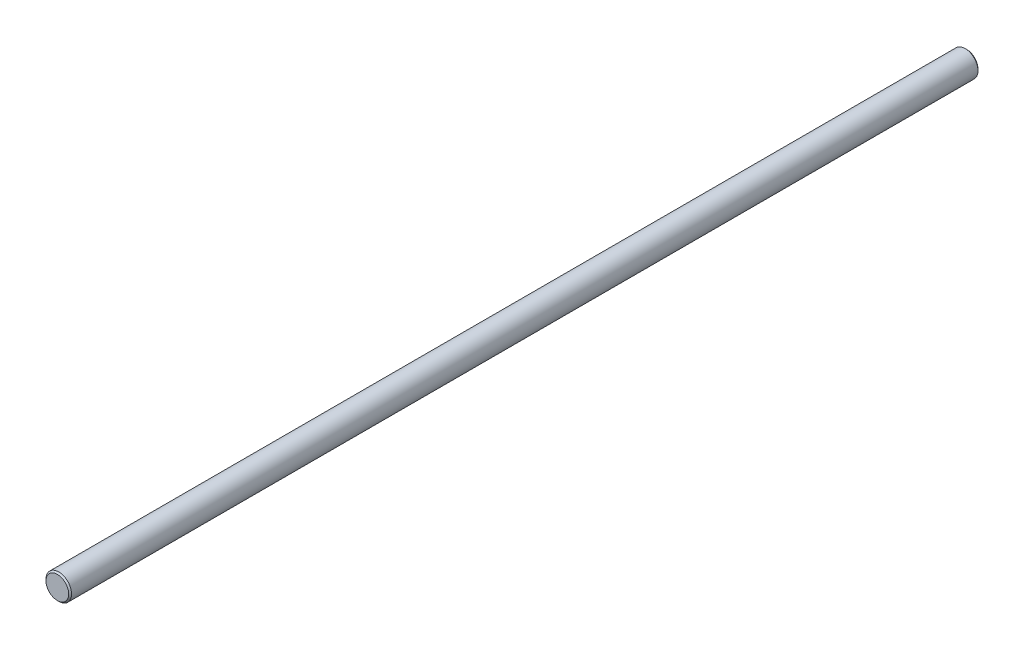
ISO-10303-21;
HEADER;
FILE_DESCRIPTION(('STEP AP214'),'2;1');
FILE_NAME('part.step','',(''),(''),'','','');
FILE_SCHEMA(('AUTOMOTIVE_DESIGN { 1 0 10303 214 1 1 1 1 }'));
ENDSEC;
DATA;
#1=APPLICATION_CONTEXT('core data for automotive mechanical design processes');
#2=APPLICATION_PROTOCOL_DEFINITION('international standard','automotive_design',2000,#1);
#3=PRODUCT_CONTEXT('',#1,'mechanical');
#4=PRODUCT('Part','Part','',(#3));
#5=PRODUCT_RELATED_PRODUCT_CATEGORY('part','',(#4));
#6=PRODUCT_DEFINITION_FORMATION('','',#4);
#7=PRODUCT_DEFINITION_CONTEXT('part definition',#1,'design');
#8=PRODUCT_DEFINITION('design','',#6,#7);
#9=PRODUCT_DEFINITION_SHAPE('','',#8);
#10=(LENGTH_UNIT() NAMED_UNIT(*) SI_UNIT(.MILLI.,.METRE.));
#11=(NAMED_UNIT(*) PLANE_ANGLE_UNIT() SI_UNIT($,.RADIAN.));
#12=(NAMED_UNIT(*) SI_UNIT($,.STERADIAN.) SOLID_ANGLE_UNIT());
#13=UNCERTAINTY_MEASURE_WITH_UNIT(LENGTH_MEASURE(1.E-05),#10,'distance_accuracy_value','');
#14=(GEOMETRIC_REPRESENTATION_CONTEXT(3) GLOBAL_UNCERTAINTY_ASSIGNED_CONTEXT((#13)) GLOBAL_UNIT_ASSIGNED_CONTEXT((#10,
#11,#12)) REPRESENTATION_CONTEXT('',''));
#15=CARTESIAN_POINT('',(0.,0.,0.));
#16=DIRECTION('',(0.,0.,1.));
#17=DIRECTION('',(1.,0.,0.));
#18=AXIS2_PLACEMENT_3D('',#15,#16,#17);
#19=CARTESIAN_POINT('',(0.,0.,160.));
#20=DIRECTION('',(0.,0.,-1.));
#21=DIRECTION('',(-1.,0.,0.));
#22=AXIS2_PLACEMENT_3D('',#19,#20,#21);
#23=CYLINDRICAL_SURFACE('',#22,4.5);
#24=CARTESIAN_POINT('',(0.,0.,-159.5));
#25=DIRECTION('',(0.,0.,1.));
#26=DIRECTION('',(1.,0.,0.));
#27=AXIS2_PLACEMENT_3D('',#24,#25,#26);
#28=CIRCLE('',#27,4.5);
#29=CARTESIAN_POINT('',(4.5,0.,-159.5));
#30=VERTEX_POINT('',#29);
#31=EDGE_CURVE('E40',#30,#30,#28,.T.);
#32=ORIENTED_EDGE('',*,*,#31,.T.);
#33=EDGE_LOOP('',(#32));
#34=FACE_BOUND('',#33,.T.);
#35=CARTESIAN_POINT('',(0.,0.,159.5));
#36=DIRECTION('',(0.,0.,1.));
#37=DIRECTION('',(1.,0.,0.));
#38=AXIS2_PLACEMENT_3D('',#35,#36,#37);
#39=CIRCLE('',#38,4.5);
#40=CARTESIAN_POINT('',(4.5,0.,159.5));
#41=VERTEX_POINT('',#40);
#42=EDGE_CURVE('E44',#41,#41,#39,.F.);
#43=ORIENTED_EDGE('',*,*,#42,.T.);
#44=EDGE_LOOP('',(#43));
#45=FACE_BOUND('',#44,.T.);
#46=ADVANCED_FACE('F29',(#34,#45),#23,.T.);
#47=CARTESIAN_POINT('',(0.,0.,160.));
#48=DIRECTION('',(0.,0.,1.));
#49=DIRECTION('',(1.,0.,0.));
#50=AXIS2_PLACEMENT_3D('',#47,#48,#49);
#51=PLANE('',#50);
#52=CARTESIAN_POINT('',(0.,0.,160.));
#53=DIRECTION('',(0.,0.,1.));
#54=DIRECTION('',(1.,0.,0.));
#55=AXIS2_PLACEMENT_3D('',#52,#53,#54);
#56=CIRCLE('',#55,4.00000000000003);
#57=CARTESIAN_POINT('',(4.00000000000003,0.,160.));
#58=VERTEX_POINT('',#57);
#59=EDGE_CURVE('E10',#58,#58,#56,.T.);
#60=ORIENTED_EDGE('',*,*,#59,.T.);
#61=EDGE_LOOP('',(#60));
#62=FACE_BOUND('',#61,.T.);
#63=ADVANCED_FACE('F60',(#62),#51,.T.);
#64=CARTESIAN_POINT('',(0.,0.,-160.));
#65=DIRECTION('',(0.,0.,1.));
#66=DIRECTION('',(1.,0.,0.));
#67=AXIS2_PLACEMENT_3D('',#64,#65,#66);
#68=PLANE('',#67);
#69=CARTESIAN_POINT('',(0.,0.,-160.));
#70=DIRECTION('',(0.,0.,1.));
#71=DIRECTION('',(1.,0.,0.));
#72=AXIS2_PLACEMENT_3D('',#69,#70,#71);
#73=CIRCLE('',#72,3.99999999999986);
#74=CARTESIAN_POINT('',(3.99999999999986,0.,-160.));
#75=VERTEX_POINT('',#74);
#76=EDGE_CURVE('E36',#75,#75,#73,.F.);
#77=ORIENTED_EDGE('',*,*,#76,.T.);
#78=EDGE_LOOP('',(#77));
#79=FACE_BOUND('',#78,.T.);
#80=ADVANCED_FACE('F57',(#79),#68,.F.);
#81=CARTESIAN_POINT('',(0.,0.,-159.5));
#82=DIRECTION('',(0.,0.,1.));
#83=DIRECTION('',(1.,0.,0.));
#84=AXIS2_PLACEMENT_3D('',#81,#82,#83);
#85=CONICAL_SURFACE('',#84,4.5,0.785398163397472);
#86=ORIENTED_EDGE('',*,*,#76,.F.);
#87=EDGE_LOOP('',(#86));
#88=FACE_BOUND('',#87,.T.);
#89=ORIENTED_EDGE('',*,*,#31,.F.);
#90=EDGE_LOOP('',(#89));
#91=FACE_BOUND('',#90,.T.);
#92=ADVANCED_FACE('F53',(#88,#91),#85,.T.);
#93=CARTESIAN_POINT('',(0.,0.,160.));
#94=DIRECTION('',(0.,0.,-1.));
#95=DIRECTION('',(-1.,0.,0.));
#96=AXIS2_PLACEMENT_3D('',#93,#94,#95);
#97=CONICAL_SURFACE('',#96,4.00000000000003,0.785398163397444);
#98=ORIENTED_EDGE('',*,*,#42,.F.);
#99=EDGE_LOOP('',(#98));
#100=FACE_BOUND('',#99,.T.);
#101=ORIENTED_EDGE('',*,*,#59,.F.);
#102=EDGE_LOOP('',(#101));
#103=FACE_BOUND('',#102,.T.);
#104=ADVANCED_FACE('F31',(#100,#103),#97,.T.);
#105=CLOSED_SHELL('',(#46,#63,#80,#92,#104));
#106=MANIFOLD_SOLID_BREP('B2',#105);
#107=ADVANCED_BREP_SHAPE_REPRESENTATION('',(#18,#106),#14);
#108=SHAPE_DEFINITION_REPRESENTATION(#9,#107);
ENDSEC;
END-ISO-10303-21;
